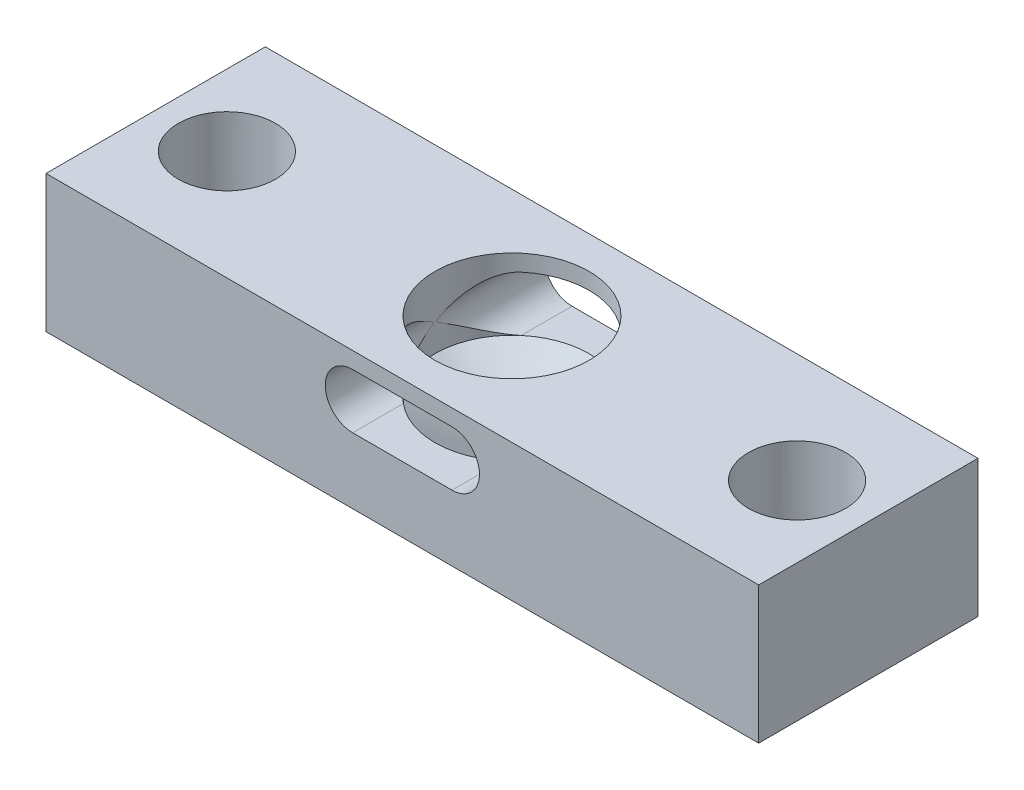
ISO-10303-21;
HEADER;
FILE_DESCRIPTION(('STEP AP214'),'2;1');
FILE_NAME('part.step','',(''),(''),'','','');
FILE_SCHEMA(('AUTOMOTIVE_DESIGN { 1 0 10303 214 1 1 1 1 }'));
ENDSEC;
DATA;
#1=APPLICATION_CONTEXT('core data for automotive mechanical design processes');
#2=APPLICATION_PROTOCOL_DEFINITION('international standard','automotive_design',2000,#1);
#3=PRODUCT_CONTEXT('',#1,'mechanical');
#4=PRODUCT('Part','Part','',(#3));
#5=PRODUCT_RELATED_PRODUCT_CATEGORY('part','',(#4));
#6=PRODUCT_DEFINITION_FORMATION('','',#4);
#7=PRODUCT_DEFINITION_CONTEXT('part definition',#1,'design');
#8=PRODUCT_DEFINITION('design','',#6,#7);
#9=PRODUCT_DEFINITION_SHAPE('','',#8);
#10=(LENGTH_UNIT() NAMED_UNIT(*) SI_UNIT(.MILLI.,.METRE.));
#11=(NAMED_UNIT(*) PLANE_ANGLE_UNIT() SI_UNIT($,.RADIAN.));
#12=(NAMED_UNIT(*) SI_UNIT($,.STERADIAN.) SOLID_ANGLE_UNIT());
#13=UNCERTAINTY_MEASURE_WITH_UNIT(LENGTH_MEASURE(1.E-05),#10,'distance_accuracy_value','');
#14=(GEOMETRIC_REPRESENTATION_CONTEXT(3) GLOBAL_UNCERTAINTY_ASSIGNED_CONTEXT((#13)) GLOBAL_UNIT_ASSIGNED_CONTEXT((#10,
#11,#12)) REPRESENTATION_CONTEXT('',''));
#15=CARTESIAN_POINT('',(0.,0.,0.));
#16=DIRECTION('',(0.,0.,1.));
#17=DIRECTION('',(1.,0.,0.));
#18=AXIS2_PLACEMENT_3D('',#15,#16,#17);
#19=CARTESIAN_POINT('',(-29.3592068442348,20.1742035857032,10.16));
#20=DIRECTION('',(1.,0.,0.));
#21=DIRECTION('',(0.,0.,-1.));
#22=AXIS2_PLACEMENT_3D('',#19,#20,#21);
#23=PLANE('',#22);
#24=DIRECTION('',(0.,0.,1.));
#25=VECTOR('',#24,1.);
#26=CARTESIAN_POINT('',(-29.3592068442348,13.8242035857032,0.));
#27=LINE('',#26,#25);
#28=CARTESIAN_POINT('',(-29.3592068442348,13.8242035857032,0.));
#29=VERTEX_POINT('',#28);
#30=CARTESIAN_POINT('',(-29.3592068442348,13.8242035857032,10.16));
#31=VERTEX_POINT('',#30);
#32=EDGE_CURVE('E60',#29,#31,#27,.T.);
#33=ORIENTED_EDGE('',*,*,#32,.T.);
#34=DIRECTION('',(0.,-1.,0.));
#35=VECTOR('',#34,1.);
#36=CARTESIAN_POINT('',(-29.3592068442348,20.1742035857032,10.16));
#37=LINE('',#36,#35);
#38=CARTESIAN_POINT('',(-29.3592068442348,20.1742035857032,10.16));
#39=VERTEX_POINT('',#38);
#40=EDGE_CURVE('E168',#39,#31,#37,.T.);
#41=ORIENTED_EDGE('',*,*,#40,.F.);
#42=DIRECTION('',(0.,0.,-1.));
#43=VECTOR('',#42,1.);
#44=CARTESIAN_POINT('',(-29.3592068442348,20.1742035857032,10.16));
#45=LINE('',#44,#43);
#46=CARTESIAN_POINT('',(-29.3592068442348,20.1742035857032,0.));
#47=VERTEX_POINT('',#46);
#48=EDGE_CURVE('E174',#39,#47,#45,.T.);
#49=ORIENTED_EDGE('',*,*,#48,.T.);
#50=DIRECTION('',(0.,-1.,0.));
#51=VECTOR('',#50,1.);
#52=CARTESIAN_POINT('',(-29.3592068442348,20.1742035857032,0.));
#53=LINE('',#52,#51);
#54=EDGE_CURVE('E162',#47,#29,#53,.T.);
#55=ORIENTED_EDGE('',*,*,#54,.T.);
#56=EDGE_LOOP('',(#33,#41,#49,#55));
#57=FACE_BOUND('',#56,.T.);
#58=ADVANCED_FACE('F44',(#57),#23,.F.);
#59=CARTESIAN_POINT('',(3.66079315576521,20.1742035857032,10.16));
#60=DIRECTION('',(-1.,0.,0.));
#61=DIRECTION('',(0.,0.,1.));
#62=AXIS2_PLACEMENT_3D('',#59,#60,#61);
#63=PLANE('',#62);
#64=DIRECTION('',(0.,0.,1.));
#65=VECTOR('',#64,1.);
#66=CARTESIAN_POINT('',(3.66079315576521,13.8242035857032,0.));
#67=LINE('',#66,#65);
#68=CARTESIAN_POINT('',(3.66079315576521,13.8242035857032,0.));
#69=VERTEX_POINT('',#68);
#70=CARTESIAN_POINT('',(3.66079315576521,13.8242035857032,10.16));
#71=VERTEX_POINT('',#70);
#72=EDGE_CURVE('E140',#69,#71,#67,.T.);
#73=ORIENTED_EDGE('',*,*,#72,.F.);
#74=DIRECTION('',(0.,1.,0.));
#75=VECTOR('',#74,1.);
#76=CARTESIAN_POINT('',(3.66079315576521,20.1742035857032,0.));
#77=LINE('',#76,#75);
#78=CARTESIAN_POINT('',(3.66079315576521,20.1742035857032,0.));
#79=VERTEX_POINT('',#78);
#80=EDGE_CURVE('E153',#69,#79,#77,.T.);
#81=ORIENTED_EDGE('',*,*,#80,.T.);
#82=DIRECTION('',(0.,0.,-1.));
#83=VECTOR('',#82,1.);
#84=CARTESIAN_POINT('',(3.66079315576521,20.1742035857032,10.16));
#85=LINE('',#84,#83);
#86=CARTESIAN_POINT('',(3.66079315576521,20.1742035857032,10.16));
#87=VERTEX_POINT('',#86);
#88=EDGE_CURVE('E178',#87,#79,#85,.T.);
#89=ORIENTED_EDGE('',*,*,#88,.F.);
#90=DIRECTION('',(0.,1.,0.));
#91=VECTOR('',#90,1.);
#92=CARTESIAN_POINT('',(3.66079315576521,20.1742035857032,10.16));
#93=LINE('',#92,#91);
#94=EDGE_CURVE('E155',#71,#87,#93,.T.);
#95=ORIENTED_EDGE('',*,*,#94,.F.);
#96=EDGE_LOOP('',(#73,#81,#89,#95));
#97=FACE_BOUND('',#96,.T.);
#98=ADVANCED_FACE('F151',(#97),#63,.F.);
#99=CARTESIAN_POINT('',(0.,0.,10.16));
#100=DIRECTION('',(0.,0.,1.));
#101=DIRECTION('',(1.,0.,0.));
#102=AXIS2_PLACEMENT_3D('',#99,#100,#101);
#103=PLANE('',#102);
#104=CARTESIAN_POINT('',(-15.1504468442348,18.1422035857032,10.16));
#105=DIRECTION('',(0.,0.,1.));
#106=DIRECTION('',(1.,0.,0.));
#107=AXIS2_PLACEMENT_3D('',#104,#105,#106);
#108=CIRCLE('',#107,1.26999999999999);
#109=CARTESIAN_POINT('',(-15.1504468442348,19.4122035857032,10.16));
#110=VERTEX_POINT('',#109);
#111=CARTESIAN_POINT('',(-15.1504468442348,16.8722035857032,10.16));
#112=VERTEX_POINT('',#111);
#113=EDGE_CURVE('E68',#110,#112,#108,.T.);
#114=ORIENTED_EDGE('',*,*,#113,.F.);
#115=DIRECTION('',(-1.,0.,0.));
#116=VECTOR('',#115,1.);
#117=CARTESIAN_POINT('',(-15.1504468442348,19.4122035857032,10.16));
#118=LINE('',#117,#116);
#119=CARTESIAN_POINT('',(-10.5479668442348,19.4122035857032,10.16));
#120=VERTEX_POINT('',#119);
#121=EDGE_CURVE('E369',#120,#110,#118,.T.);
#122=ORIENTED_EDGE('',*,*,#121,.F.);
#123=CARTESIAN_POINT('',(-10.5479668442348,18.1422035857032,10.16));
#124=DIRECTION('',(0.,0.,1.));
#125=DIRECTION('',(1.,0.,0.));
#126=AXIS2_PLACEMENT_3D('',#123,#124,#125);
#127=CIRCLE('',#126,1.26999999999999);
#128=CARTESIAN_POINT('',(-10.5479668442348,16.8722035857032,10.16));
#129=VERTEX_POINT('',#128);
#130=EDGE_CURVE('E375',#129,#120,#127,.T.);
#131=ORIENTED_EDGE('',*,*,#130,.F.);
#132=DIRECTION('',(1.,0.,0.));
#133=VECTOR('',#132,1.);
#134=CARTESIAN_POINT('',(-15.1504468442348,16.8722035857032,10.16));
#135=LINE('',#134,#133);
#136=EDGE_CURVE('E381',#112,#129,#135,.T.);
#137=ORIENTED_EDGE('',*,*,#136,.F.);
#138=EDGE_LOOP('',(#114,#122,#131,#137));
#139=FACE_BOUND('',#138,.T.);
#140=ORIENTED_EDGE('',*,*,#40,.T.);
#141=DIRECTION('',(1.,0.,0.));
#142=VECTOR('',#141,1.);
#143=CARTESIAN_POINT('',(0.,13.8242035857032,10.16));
#144=LINE('',#143,#142);
#145=EDGE_CURVE('E147',#31,#71,#144,.T.);
#146=ORIENTED_EDGE('',*,*,#145,.T.);
#147=ORIENTED_EDGE('',*,*,#94,.T.);
#148=DIRECTION('',(-1.,0.,0.));
#149=VECTOR('',#148,1.);
#150=CARTESIAN_POINT('',(-29.3592068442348,20.1742035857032,10.16));
#151=LINE('',#150,#149);
#152=EDGE_CURVE('E179',#87,#39,#151,.T.);
#153=ORIENTED_EDGE('',*,*,#152,.T.);
#154=EDGE_LOOP('',(#140,#146,#147,#153));
#155=FACE_BOUND('',#154,.T.);
#156=ADVANCED_FACE('F244',(#139,#155),#103,.T.);
#157=CARTESIAN_POINT('',(0.,0.,0.));
#158=DIRECTION('',(0.,0.,1.));
#159=DIRECTION('',(1.,0.,0.));
#160=AXIS2_PLACEMENT_3D('',#157,#158,#159);
#161=PLANE('',#160);
#162=DIRECTION('',(-1.,0.,0.));
#163=VECTOR('',#162,1.);
#164=CARTESIAN_POINT('',(-15.1504468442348,19.4122035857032,0.));
#165=LINE('',#164,#163);
#166=CARTESIAN_POINT('',(-10.5479668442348,19.4122035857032,0.));
#167=VERTEX_POINT('',#166);
#168=CARTESIAN_POINT('',(-15.1504468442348,19.4122035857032,0.));
#169=VERTEX_POINT('',#168);
#170=EDGE_CURVE('E346',#167,#169,#165,.T.);
#171=ORIENTED_EDGE('',*,*,#170,.T.);
#172=CARTESIAN_POINT('',(-15.1504468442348,18.1422035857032,0.));
#173=DIRECTION('',(0.,0.,1.));
#174=DIRECTION('',(1.,0.,0.));
#175=AXIS2_PLACEMENT_3D('',#172,#173,#174);
#176=CIRCLE('',#175,1.26999999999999);
#177=CARTESIAN_POINT('',(-15.1504468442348,16.8722035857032,0.));
#178=VERTEX_POINT('',#177);
#179=EDGE_CURVE('E363',#169,#178,#176,.T.);
#180=ORIENTED_EDGE('',*,*,#179,.T.);
#181=DIRECTION('',(1.,0.,0.));
#182=VECTOR('',#181,1.);
#183=CARTESIAN_POINT('',(-15.1504468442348,16.8722035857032,0.));
#184=LINE('',#183,#182);
#185=CARTESIAN_POINT('',(-10.5479668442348,16.8722035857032,0.));
#186=VERTEX_POINT('',#185);
#187=EDGE_CURVE('E357',#178,#186,#184,.T.);
#188=ORIENTED_EDGE('',*,*,#187,.T.);
#189=CARTESIAN_POINT('',(-10.5479668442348,18.1422035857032,0.));
#190=DIRECTION('',(0.,0.,1.));
#191=DIRECTION('',(1.,0.,0.));
#192=AXIS2_PLACEMENT_3D('',#189,#190,#191);
#193=CIRCLE('',#192,1.26999999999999);
#194=EDGE_CURVE('E351',#186,#167,#193,.T.);
#195=ORIENTED_EDGE('',*,*,#194,.T.);
#196=EDGE_LOOP('',(#171,#180,#188,#195));
#197=FACE_BOUND('',#196,.T.);
#198=DIRECTION('',(1.,0.,0.));
#199=VECTOR('',#198,1.);
#200=CARTESIAN_POINT('',(0.,13.8242035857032,0.));
#201=LINE('',#200,#199);
#202=EDGE_CURVE('E136',#29,#69,#201,.T.);
#203=ORIENTED_EDGE('',*,*,#202,.F.);
#204=ORIENTED_EDGE('',*,*,#54,.F.);
#205=DIRECTION('',(-1.,0.,0.));
#206=VECTOR('',#205,1.);
#207=CARTESIAN_POINT('',(-29.3592068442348,20.1742035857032,0.));
#208=LINE('',#207,#206);
#209=EDGE_CURVE('E160',#79,#47,#208,.T.);
#210=ORIENTED_EDGE('',*,*,#209,.F.);
#211=ORIENTED_EDGE('',*,*,#80,.F.);
#212=EDGE_LOOP('',(#203,#204,#210,#211));
#213=FACE_BOUND('',#212,.T.);
#214=ADVANCED_FACE('F159',(#197,#213),#161,.F.);
#215=CARTESIAN_POINT('',(0.358793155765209,20.1742035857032,5.08));
#216=DIRECTION('',(0.,1.,0.));
#217=DIRECTION('',(0.,0.,1.));
#218=AXIS2_PLACEMENT_3D('',#215,#216,#217);
#219=CYLINDRICAL_SURFACE('',#218,2.2479);
#220=CARTESIAN_POINT('',(0.358793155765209,20.1742035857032,5.08));
#221=DIRECTION('',(0.,1.,0.));
#222=DIRECTION('',(0.,0.,1.));
#223=AXIS2_PLACEMENT_3D('',#220,#221,#222);
#224=CIRCLE('',#223,2.2479);
#225=CARTESIAN_POINT('',(0.358793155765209,20.1742035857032,7.3279));
#226=VERTEX_POINT('',#225);
#227=EDGE_CURVE('E170',#226,#226,#224,.T.);
#228=ORIENTED_EDGE('',*,*,#227,.T.);
#229=EDGE_LOOP('',(#228));
#230=FACE_BOUND('',#229,.T.);
#231=CARTESIAN_POINT('',(0.358793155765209,13.8242035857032,5.08));
#232=DIRECTION('',(0.,-1.,0.));
#233=DIRECTION('',(0.,0.,-1.));
#234=AXIS2_PLACEMENT_3D('',#231,#232,#233);
#235=CIRCLE('',#234,2.2479);
#236=CARTESIAN_POINT('',(0.358793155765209,13.8242035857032,2.8321));
#237=VERTEX_POINT('',#236);
#238=EDGE_CURVE('E391',#237,#237,#235,.F.);
#239=ORIENTED_EDGE('',*,*,#238,.F.);
#240=EDGE_LOOP('',(#239));
#241=FACE_BOUND('',#240,.T.);
#242=ADVANCED_FACE('F418',(#230,#241),#219,.F.);
#243=CARTESIAN_POINT('',(-26.0572068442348,20.1742035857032,5.08));
#244=DIRECTION('',(0.,1.,0.));
#245=DIRECTION('',(0.,0.,1.));
#246=AXIS2_PLACEMENT_3D('',#243,#244,#245);
#247=CYLINDRICAL_SURFACE('',#246,2.2479);
#248=CARTESIAN_POINT('',(-26.0572068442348,20.1742035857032,5.08));
#249=DIRECTION('',(0.,1.,0.));
#250=DIRECTION('',(0.,0.,1.));
#251=AXIS2_PLACEMENT_3D('',#248,#249,#250);
#252=CIRCLE('',#251,2.2479);
#253=CARTESIAN_POINT('',(-26.0572068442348,20.1742035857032,7.3279));
#254=VERTEX_POINT('',#253);
#255=EDGE_CURVE('E275',#254,#254,#252,.T.);
#256=ORIENTED_EDGE('',*,*,#255,.T.);
#257=EDGE_LOOP('',(#256));
#258=FACE_BOUND('',#257,.T.);
#259=CARTESIAN_POINT('',(-26.0572068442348,13.8242035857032,5.08));
#260=DIRECTION('',(0.,-1.,0.));
#261=DIRECTION('',(0.,0.,-1.));
#262=AXIS2_PLACEMENT_3D('',#259,#260,#261);
#263=CIRCLE('',#262,2.2479);
#264=CARTESIAN_POINT('',(-26.0572068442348,13.8242035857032,2.8321));
#265=VERTEX_POINT('',#264);
#266=EDGE_CURVE('E47',#265,#265,#263,.F.);
#267=ORIENTED_EDGE('',*,*,#266,.F.);
#268=EDGE_LOOP('',(#267));
#269=FACE_BOUND('',#268,.T.);
#270=ADVANCED_FACE('F415',(#258,#269),#247,.F.);
#271=CARTESIAN_POINT('',(-29.3592068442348,20.1742035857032,10.16));
#272=DIRECTION('',(0.,-1.,0.));
#273=DIRECTION('',(0.,0.,-1.));
#274=AXIS2_PLACEMENT_3D('',#271,#272,#273);
#275=PLANE('',#274);
#276=CARTESIAN_POINT('',(-12.8492068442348,20.1742035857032,5.08));
#277=DIRECTION('',(0.,1.,0.));
#278=DIRECTION('',(0.,0.,1.));
#279=AXIS2_PLACEMENT_3D('',#276,#277,#278);
#280=CIRCLE('',#279,3.571875);
#281=CARTESIAN_POINT('',(-12.8492068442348,20.1742035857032,8.651875));
#282=VERTEX_POINT('',#281);
#283=EDGE_CURVE('E301',#282,#282,#280,.T.);
#284=ORIENTED_EDGE('',*,*,#283,.F.);
#285=EDGE_LOOP('',(#284));
#286=FACE_BOUND('',#285,.T.);
#287=ORIENTED_EDGE('',*,*,#255,.F.);
#288=EDGE_LOOP('',(#287));
#289=FACE_BOUND('',#288,.T.);
#290=ORIENTED_EDGE('',*,*,#227,.F.);
#291=EDGE_LOOP('',(#290));
#292=FACE_BOUND('',#291,.T.);
#293=ORIENTED_EDGE('',*,*,#209,.T.);
#294=ORIENTED_EDGE('',*,*,#48,.F.);
#295=ORIENTED_EDGE('',*,*,#152,.F.);
#296=ORIENTED_EDGE('',*,*,#88,.T.);
#297=EDGE_LOOP('',(#293,#294,#295,#296));
#298=FACE_BOUND('',#297,.T.);
#299=ADVANCED_FACE('F417',(#286,#289,#292,#298),#275,.F.);
#300=CARTESIAN_POINT('',(-12.8492068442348,16.8722035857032,5.08));
#301=DIRECTION('',(0.,1.,0.));
#302=DIRECTION('',(0.,0.,1.));
#303=AXIS2_PLACEMENT_3D('',#300,#301,#302);
#304=CONICAL_SURFACE('',#303,3.571875,1.02974425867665);
#305=CARTESIAN_POINT('',(-12.8492068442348,14.7260045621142,5.08));
#306=VERTEX_POINT('',#305);
#307=VERTEX_LOOP('',#306);
#308=FACE_BOUND('',#307,.T.);
#309=CARTESIAN_POINT('',(-12.8492068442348,16.8722035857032,5.08));
#310=DIRECTION('',(0.,1.,0.));
#311=DIRECTION('',(0.,0.,1.));
#312=AXIS2_PLACEMENT_3D('',#309,#310,#311);
#313=CIRCLE('',#312,3.571875);
#314=CARTESIAN_POINT('',(-10.5479668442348,16.8722035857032,7.81177332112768));
#315=VERTEX_POINT('',#314);
#316=CARTESIAN_POINT('',(-10.5479668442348,16.8722035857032,2.34822667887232));
#317=VERTEX_POINT('',#316);
#318=EDGE_CURVE('E280',#315,#317,#313,.T.);
#319=ORIENTED_EDGE('',*,*,#318,.T.);
#320=CARTESIAN_POINT('',(-15.1504468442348,16.8722035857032,2.34822667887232));
#321=VERTEX_POINT('',#320);
#322=EDGE_CURVE('E285',#317,#321,#313,.T.);
#323=ORIENTED_EDGE('',*,*,#322,.T.);
#324=CARTESIAN_POINT('',(-15.1504468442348,16.8722035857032,7.81177332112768));
#325=VERTEX_POINT('',#324);
#326=EDGE_CURVE('E292',#321,#325,#313,.T.);
#327=ORIENTED_EDGE('',*,*,#326,.T.);
#328=EDGE_CURVE('E287',#325,#315,#313,.T.);
#329=ORIENTED_EDGE('',*,*,#328,.T.);
#330=EDGE_LOOP('',(#319,#323,#327,#329));
#331=FACE_BOUND('',#330,.T.);
#332=ADVANCED_FACE('F425',(#308,#331),#304,.F.);
#333=CARTESIAN_POINT('',(-12.8492068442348,20.1742035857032,5.08));
#334=DIRECTION('',(0.,1.,0.));
#335=DIRECTION('',(0.,0.,1.));
#336=AXIS2_PLACEMENT_3D('',#333,#334,#335);
#337=CYLINDRICAL_SURFACE('',#336,3.571875);
#338=ORIENTED_EDGE('',*,*,#326,.F.);
#339=CARTESIAN_POINT('',(-15.1504468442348,16.8722035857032,2.34822667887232));
#340=CARTESIAN_POINT('',(-15.1918067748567,16.8722092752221,2.38306230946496));
#341=CARTESIAN_POINT('',(-15.2323323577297,16.8742227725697,2.41881308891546));
#342=CARTESIAN_POINT('',(-15.3114918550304,16.8818282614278,2.49188591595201));
#343=CARTESIAN_POINT('',(-15.3501283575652,16.8874152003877,2.52920567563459));
#344=CARTESIAN_POINT('',(-15.4623698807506,16.9087638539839,2.64260310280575));
#345=CARTESIAN_POINT('',(-15.5330504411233,16.9291294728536,2.72074810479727));
#346=CARTESIAN_POINT('',(-15.65157078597,16.9739216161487,2.86375437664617));
#347=CARTESIAN_POINT('',(-15.7010561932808,16.9965371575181,2.92786496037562));
#348=CARTESIAN_POINT('',(-15.7947853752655,17.0465089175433,3.05804902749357));
#349=CARTESIAN_POINT('',(-15.8390285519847,17.0738656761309,3.12412273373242));
#350=CARTESIAN_POINT('',(-15.9225974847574,17.1325951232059,3.25822979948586));
#351=CARTESIAN_POINT('',(-15.9618897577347,17.1639925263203,3.32627303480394));
#352=CARTESIAN_POINT('',(-16.0353523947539,17.2299115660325,3.46357503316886));
#353=CARTESIAN_POINT('',(-16.0695229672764,17.2644330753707,3.53283374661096));
#354=CARTESIAN_POINT('',(-16.1476004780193,17.3525936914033,3.70469277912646));
#355=CARTESIAN_POINT('',(-16.1886684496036,17.4076711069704,3.80785268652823));
#356=CARTESIAN_POINT('',(-16.2605858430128,17.521691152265,4.01562955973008));
#357=CARTESIAN_POINT('',(-16.2914284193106,17.5806363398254,4.12024745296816));
#358=CARTESIAN_POINT('',(-16.3431348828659,17.7009816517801,4.33007632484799));
#359=CARTESIAN_POINT('',(-16.3640300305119,17.7623734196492,4.43528438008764));
#360=CARTESIAN_POINT('',(-16.3881645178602,17.8558723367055,4.59326734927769));
#361=CARTESIAN_POINT('',(-16.3950071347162,17.8872655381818,4.64594315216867));
#362=CARTESIAN_POINT('',(-16.4063145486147,17.9505323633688,4.75125800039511));
#363=CARTESIAN_POINT('',(-16.410779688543,17.9824059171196,4.80389704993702));
#364=CARTESIAN_POINT('',(-16.415452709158,18.0288325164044,4.87832155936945));
#365=CARTESIAN_POINT('',(-16.4166313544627,18.0427875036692,4.90041463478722));
#366=CARTESIAN_POINT('',(-16.4181926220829,18.0660434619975,4.93573036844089));
#367=CARTESIAN_POINT('',(-16.4187073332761,18.0750859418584,4.94911767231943));
#368=CARTESIAN_POINT('',(-16.4194109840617,18.0905657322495,4.97045273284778));
#369=CARTESIAN_POINT('',(-16.4196500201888,18.0967308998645,4.97858243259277));
#370=CARTESIAN_POINT('',(-16.4199554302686,18.1067210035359,4.99021576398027));
#371=CARTESIAN_POINT('',(-16.420048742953,18.1101961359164,4.99401950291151));
#372=CARTESIAN_POINT('',(-16.4202138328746,18.1175925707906,5.00118201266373));
#373=CARTESIAN_POINT('',(-16.4202857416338,18.1215109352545,5.00454342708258));
#374=CARTESIAN_POINT('',(-16.4203628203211,18.1275039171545,5.00832554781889));
#375=CARTESIAN_POINT('',(-16.4203818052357,18.1292260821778,5.00928167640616));
#376=CARTESIAN_POINT('',(-16.4204133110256,18.1328039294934,5.01089127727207));
#377=CARTESIAN_POINT('',(-16.4204258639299,18.134658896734,5.01154624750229));
#378=CARTESIAN_POINT('',(-16.4204403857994,18.1379296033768,5.01230867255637));
#379=CARTESIAN_POINT('',(-16.4204443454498,18.1393209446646,5.01251865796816));
#380=CARTESIAN_POINT('',(-16.4204476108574,18.1421198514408,5.01269166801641));
#381=CARTESIAN_POINT('',(-16.4204469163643,18.1435274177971,5.01265467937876));
#382=CARTESIAN_POINT('',(-16.4204409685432,18.1463094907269,5.01234007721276));
#383=CARTESIAN_POINT('',(-16.4204357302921,18.1476840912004,5.01206325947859));
#384=CARTESIAN_POINT('',(-16.4204212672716,18.1503754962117,5.01130717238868));
#385=CARTESIAN_POINT('',(-16.4204120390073,18.1516922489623,5.01082772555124));
#386=CARTESIAN_POINT('',(-16.4203817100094,18.1552699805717,5.00927483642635));
#387=CARTESIAN_POINT('',(-16.4203569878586,18.1574557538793,5.00803126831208));
#388=CARTESIAN_POINT('',(-16.4202998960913,18.1616344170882,5.0052506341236));
#389=CARTESIAN_POINT('',(-16.4202674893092,18.163626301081,5.00371214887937));
#390=CARTESIAN_POINT('',(-16.4201001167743,18.1727598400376,4.99605029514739));
#391=CARTESIAN_POINT('',(-16.4199278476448,18.1790260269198,4.98893574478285));
#392=CARTESIAN_POINT('',(-16.4195238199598,18.1909577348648,4.97423769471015));
#393=CARTESIAN_POINT('',(-16.419291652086,18.1966187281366,4.96665125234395));
#394=CARTESIAN_POINT('',(-16.4180033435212,18.2239852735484,4.92872129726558));
#395=CARTESIAN_POINT('',(-16.4165323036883,18.2439045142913,4.89707906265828));
#396=CARTESIAN_POINT('',(-16.4127335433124,18.2832668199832,4.83383897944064));
#397=CARTESIAN_POINT('',(-16.4104096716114,18.3027116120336,4.80224156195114));
#398=CARTESIAN_POINT('',(-16.4021219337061,18.360750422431,4.70699877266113));
#399=CARTESIAN_POINT('',(-16.394850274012,18.3988874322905,4.6431576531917));
#400=CARTESIAN_POINT('',(-16.3768017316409,18.4745471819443,4.51561121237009));
#401=CARTESIAN_POINT('',(-16.3660236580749,18.5120697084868,4.45190594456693));
#402=CARTESIAN_POINT('',(-16.3282496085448,18.6237551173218,4.26055463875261));
#403=CARTESIAN_POINT('',(-16.2958582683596,18.6967186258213,4.13319743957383));
#404=CARTESIAN_POINT('',(-16.2276198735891,18.8174279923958,3.91656787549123));
#405=CARTESIAN_POINT('',(-16.19541130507,18.8664174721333,3.82682161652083));
#406=CARTESIAN_POINT('',(-16.1231366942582,18.9609320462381,3.64859540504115));
#407=CARTESIAN_POINT('',(-16.0830681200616,19.0064560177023,3.56011587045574));
#408=CARTESIAN_POINT('',(-15.9950736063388,19.0926107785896,3.38550478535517));
#409=CARTESIAN_POINT('',(-15.9471987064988,19.1332705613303,3.29936196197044));
#410=CARTESIAN_POINT('',(-15.84314747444,19.2085940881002,3.12948237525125));
#411=CARTESIAN_POINT('',(-15.7869748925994,19.2432605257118,3.04574454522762));
#412=CARTESIAN_POINT('',(-15.6862113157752,19.2945521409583,2.90874648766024));
#413=CARTESIAN_POINT('',(-15.6439492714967,19.3133493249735,2.85458050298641));
#414=CARTESIAN_POINT('',(-15.5557092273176,19.3467307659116,2.74806614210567));
#415=CARTESIAN_POINT('',(-15.5097345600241,19.3613187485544,2.69571619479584));
#416=CARTESIAN_POINT('',(-15.4135855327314,19.3856451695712,2.59257799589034));
#417=CARTESIAN_POINT('',(-15.3633680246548,19.395324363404,2.54181545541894));
#418=CARTESIAN_POINT('',(-15.2594259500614,19.4086026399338,2.44289294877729));
#419=CARTESIAN_POINT('',(-15.2056921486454,19.4121849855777,2.39474049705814));
#420=CARTESIAN_POINT('',(-15.1504468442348,19.4122035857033,2.34822667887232));
#421=B_SPLINE_CURVE_WITH_KNOTS('',3,(#339,#340,#341,#342,#343,#344,#345,#346,#347,#348,#349,
#350,#351,#352,#353,#354,#355,#356,#357,#358,#359,#360,#361,#362,#363,#364,#365,#366,#367,#368,
#369,#370,#371,#372,#373,#374,#375,#376,#377,#378,#379,#380,#381,#382,#383,#384,#385,#386,#387,
#388,#389,#390,#391,#392,#393,#394,#395,#396,#397,#398,#399,#400,#401,#402,#403,#404,#405,#406,
#407,#408,#409,#410,#411,#412,#413,#414,#415,#416,#417,#418,#419,#420),.UNSPECIFIED.,.F.,.F.,(4,
2,2,2,2,2,2,2,2,2,2,2,2,2,2,2,2,2,2,2,2,2,2,2,2,2,2,2,2,2,2,2,2,2,2,2,2,2,2,2,4),(0.,
0.162096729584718,0.323964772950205,0.64480874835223,0.896759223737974,1.14873841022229,
1.4023394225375,1.65593010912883,2.02718517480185,2.39868828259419,2.76901608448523,
2.95408412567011,3.13912546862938,3.21758499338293,3.2660735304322,3.2966434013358,
3.31210071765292,3.32746099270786,3.33335237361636,3.33921412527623,3.34341568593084,
3.34761747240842,3.35180536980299,3.35599694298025,3.36349749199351,3.37103508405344,
3.39926687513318,3.42769694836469,3.53975420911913,3.65131185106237,3.87533225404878,
4.09942882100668,4.54945817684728,4.87076542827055,5.19217635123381,5.51156438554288,
5.83080850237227,6.0442814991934,6.25756495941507,6.47336469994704,6.68975590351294),.UNSPECIFIED.);
#422=CARTESIAN_POINT('',(-15.1504468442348,19.4122035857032,2.34822667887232));
#423=VERTEX_POINT('',#422);
#424=EDGE_CURVE('E11',#321,#423,#421,.T.);
#425=ORIENTED_EDGE('',*,*,#424,.T.);
#426=CARTESIAN_POINT('',(-12.8492068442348,19.4122035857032,5.08));
#427=DIRECTION('',(0.,1.,0.));
#428=DIRECTION('',(0.,0.,1.));
#429=AXIS2_PLACEMENT_3D('',#426,#427,#428);
#430=CIRCLE('',#429,3.571875);
#431=CARTESIAN_POINT('',(-10.5479668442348,19.4122035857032,2.34822667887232));
#432=VERTEX_POINT('',#431);
#433=EDGE_CURVE('E53',#423,#432,#430,.F.);
#434=ORIENTED_EDGE('',*,*,#433,.T.);
#435=CARTESIAN_POINT('',(-10.5479668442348,19.4122035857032,2.34822667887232));
#436=CARTESIAN_POINT('',(-10.5066069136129,19.4121978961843,2.38306230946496));
#437=CARTESIAN_POINT('',(-10.4660813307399,19.4101843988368,2.41881308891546));
#438=CARTESIAN_POINT('',(-10.3869218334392,19.4025789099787,2.49188591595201));
#439=CARTESIAN_POINT('',(-10.3482853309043,19.3969919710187,2.52920567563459));
#440=CARTESIAN_POINT('',(-10.236043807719,19.3756433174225,2.64260310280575));
#441=CARTESIAN_POINT('',(-10.1653632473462,19.3552776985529,2.72074810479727));
#442=CARTESIAN_POINT('',(-10.0468429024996,19.3104855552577,2.86375437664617));
#443=CARTESIAN_POINT('',(-9.99735749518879,19.2878700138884,2.92786496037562));
#444=CARTESIAN_POINT('',(-9.90362831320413,19.2378982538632,3.05804902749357));
#445=CARTESIAN_POINT('',(-9.85938513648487,19.2105414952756,3.12412273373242));
#446=CARTESIAN_POINT('',(-9.77581620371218,19.1518120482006,3.25822979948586));
#447=CARTESIAN_POINT('',(-9.73652393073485,19.1204146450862,3.32627303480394));
#448=CARTESIAN_POINT('',(-9.66306129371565,19.054495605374,3.46357503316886));
#449=CARTESIAN_POINT('',(-9.62889072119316,19.0199740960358,3.53283374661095));
#450=CARTESIAN_POINT('',(-9.55081321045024,18.9318134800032,3.70469277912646));
#451=CARTESIAN_POINT('',(-9.50974523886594,18.8767360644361,3.80785268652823));
#452=CARTESIAN_POINT('',(-9.43782784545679,18.7627160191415,4.01562955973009));
#453=CARTESIAN_POINT('',(-9.40698526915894,18.7037708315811,4.12024745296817));
#454=CARTESIAN_POINT('',(-9.35527880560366,18.5834255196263,4.33007632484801));
#455=CARTESIAN_POINT('',(-9.33438365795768,18.5220337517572,4.43528438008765));
#456=CARTESIAN_POINT('',(-9.31024917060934,18.428534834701,4.5932673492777));
#457=CARTESIAN_POINT('',(-9.30340655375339,18.3971416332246,4.64594315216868));
#458=CARTESIAN_POINT('',(-9.29209913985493,18.3338748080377,4.75125800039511));
#459=CARTESIAN_POINT('',(-9.28763399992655,18.3020012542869,4.80389704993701));
#460=CARTESIAN_POINT('',(-9.28296097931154,18.255574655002,4.87832155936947));
#461=CARTESIAN_POINT('',(-9.28178233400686,18.2416196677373,4.90041463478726));
#462=CARTESIAN_POINT('',(-9.28022106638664,18.2183637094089,4.93573036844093));
#463=CARTESIAN_POINT('',(-9.27970635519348,18.2093212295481,4.94911767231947));
#464=CARTESIAN_POINT('',(-9.27900270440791,18.193841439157,4.97045273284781));
#465=CARTESIAN_POINT('',(-9.27876366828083,18.187676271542,4.97858243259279));
#466=CARTESIAN_POINT('',(-9.27845825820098,18.1776861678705,4.99021576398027));
#467=CARTESIAN_POINT('',(-9.27836494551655,18.17421103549,4.99401950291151));
#468=CARTESIAN_POINT('',(-9.278199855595,18.1668146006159,5.00118201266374));
#469=CARTESIAN_POINT('',(-9.2781279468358,18.162896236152,5.00454342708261));
#470=CARTESIAN_POINT('',(-9.27805086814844,18.156903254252,5.00832554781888));
#471=CARTESIAN_POINT('',(-9.27803188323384,18.1551810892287,5.00928167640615));
#472=CARTESIAN_POINT('',(-9.27800037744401,18.1516032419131,5.01089127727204));
#473=CARTESIAN_POINT('',(-9.27798782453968,18.1497482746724,5.01154624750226));
#474=CARTESIAN_POINT('',(-9.27797330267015,18.1464775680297,5.01230867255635));
#475=CARTESIAN_POINT('',(-9.27796934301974,18.1450862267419,5.01251865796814));
#476=CARTESIAN_POINT('',(-9.27796607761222,18.1422873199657,5.0126916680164));
#477=CARTESIAN_POINT('',(-9.27796677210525,18.1408797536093,5.01265467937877));
#478=CARTESIAN_POINT('',(-9.27797271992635,18.1380976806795,5.01234007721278));
#479=CARTESIAN_POINT('',(-9.27797795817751,18.1367230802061,5.01206325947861));
#480=CARTESIAN_POINT('',(-9.27799242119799,18.1340316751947,5.01130717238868));
#481=CARTESIAN_POINT('',(-9.2780016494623,18.1327149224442,5.01082772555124));
#482=CARTESIAN_POINT('',(-9.27803197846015,18.1291371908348,5.00927483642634));
#483=CARTESIAN_POINT('',(-9.27805670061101,18.1269514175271,5.00803126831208));
#484=CARTESIAN_POINT('',(-9.2781137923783,18.1227727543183,5.0052506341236));
#485=CARTESIAN_POINT('',(-9.27814619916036,18.1207808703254,5.00371214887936));
#486=CARTESIAN_POINT('',(-9.27831357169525,18.1116473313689,4.99605029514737));
#487=CARTESIAN_POINT('',(-9.27848584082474,18.1053811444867,4.98893574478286));
#488=CARTESIAN_POINT('',(-9.27888986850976,18.0934494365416,4.97423769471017));
#489=CARTESIAN_POINT('',(-9.27912203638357,18.0877884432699,4.96665125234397));
#490=CARTESIAN_POINT('',(-9.28041034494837,18.0604218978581,4.9287212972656));
#491=CARTESIAN_POINT('',(-9.28188138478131,18.0405026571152,4.89707906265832));
#492=CARTESIAN_POINT('',(-9.28568014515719,18.0011403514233,4.83383897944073));
#493=CARTESIAN_POINT('',(-9.28800401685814,17.981695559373,4.80224156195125));
#494=CARTESIAN_POINT('',(-9.29629175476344,17.9236567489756,4.70699877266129));
#495=CARTESIAN_POINT('',(-9.30356341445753,17.8855197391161,4.64315765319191));
#496=CARTESIAN_POINT('',(-9.32161195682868,17.8098599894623,4.51561121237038));
#497=CARTESIAN_POINT('',(-9.33239003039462,17.7723374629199,4.45190594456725));
#498=CARTESIAN_POINT('',(-9.37016407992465,17.6606520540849,4.26055463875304));
#499=CARTESIAN_POINT('',(-9.40255542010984,17.5876885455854,4.13319743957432));
#500=CARTESIAN_POINT('',(-9.47079381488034,17.4669791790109,3.91656787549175));
#501=CARTESIAN_POINT('',(-9.50300238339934,17.4179896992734,3.82682161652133));
#502=CARTESIAN_POINT('',(-9.57527699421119,17.3234751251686,3.64859540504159));
#503=CARTESIAN_POINT('',(-9.61534556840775,17.2779511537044,3.56011587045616));
#504=CARTESIAN_POINT('',(-9.70334008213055,17.191796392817,3.38550478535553));
#505=CARTESIAN_POINT('',(-9.75121498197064,17.1511366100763,3.29936196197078));
#506=CARTESIAN_POINT('',(-9.85526621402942,17.0758130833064,3.12948237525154));
#507=CARTESIAN_POINT('',(-9.91143879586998,17.0411466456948,3.04574454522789));
#508=CARTESIAN_POINT('',(-10.0122023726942,16.9898550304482,2.90874648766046));
#509=CARTESIAN_POINT('',(-10.0544644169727,16.971057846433,2.8545805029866));
#510=CARTESIAN_POINT('',(-10.1427044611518,16.9376764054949,2.74806614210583));
#511=CARTESIAN_POINT('',(-10.1886791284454,16.9230884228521,2.69571619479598));
#512=CARTESIAN_POINT('',(-10.2848281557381,16.8987620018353,2.59257799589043));
#513=CARTESIAN_POINT('',(-10.3350456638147,16.8890828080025,2.54181545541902));
#514=CARTESIAN_POINT('',(-10.4389877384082,16.8758045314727,2.44289294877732));
#515=CARTESIAN_POINT('',(-10.4927215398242,16.8722221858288,2.39474049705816));
#516=CARTESIAN_POINT('',(-10.5479668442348,16.8722035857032,2.34822667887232));
#517=B_SPLINE_CURVE_WITH_KNOTS('',3,(#435,#436,#437,#438,#439,#440,#441,#442,#443,#444,#445,
#446,#447,#448,#449,#450,#451,#452,#453,#454,#455,#456,#457,#458,#459,#460,#461,#462,#463,#464,
#465,#466,#467,#468,#469,#470,#471,#472,#473,#474,#475,#476,#477,#478,#479,#480,#481,#482,#483,
#484,#485,#486,#487,#488,#489,#490,#491,#492,#493,#494,#495,#496,#497,#498,#499,#500,#501,#502,
#503,#504,#505,#506,#507,#508,#509,#510,#511,#512,#513,#514,#515,#516),.UNSPECIFIED.,.F.,.F.,(4,
2,2,2,2,2,2,2,2,2,2,2,2,2,2,2,2,2,2,2,2,2,2,2,2,2,2,2,2,2,2,2,2,2,2,2,2,2,2,2,4),(0.,
0.162096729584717,0.323964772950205,0.64480874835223,0.896759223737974,1.14873841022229,
1.40233942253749,1.65593010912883,2.02718517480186,2.39868828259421,2.76901608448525,
2.95408412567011,3.13912546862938,3.21758499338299,3.26607353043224,3.29664340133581,
3.31210071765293,3.32746099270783,3.33335237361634,3.33921412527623,3.34341568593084,
3.34761747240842,3.351805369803,3.35599694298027,3.36349749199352,3.37103508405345,
3.39926687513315,3.42769694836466,3.53975420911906,3.65131185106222,3.87533225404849,
4.09942882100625,4.54945817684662,4.87076542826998,5.19217635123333,5.51156438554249,
5.83080850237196,6.04428149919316,6.25756495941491,6.47336469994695,6.68975590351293),.UNSPECIFIED.);
#518=EDGE_CURVE('E211',#432,#317,#517,.T.);
#519=ORIENTED_EDGE('',*,*,#518,.T.);
#520=ORIENTED_EDGE('',*,*,#318,.F.);
#521=CARTESIAN_POINT('',(-10.5479668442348,16.8722035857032,7.81177332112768));
#522=CARTESIAN_POINT('',(-10.5066069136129,16.8722092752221,7.77693769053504));
#523=CARTESIAN_POINT('',(-10.4660813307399,16.8742227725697,7.74118691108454));
#524=CARTESIAN_POINT('',(-10.3869218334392,16.8818282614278,7.66811408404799));
#525=CARTESIAN_POINT('',(-10.3482853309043,16.8874152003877,7.63079432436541));
#526=CARTESIAN_POINT('',(-10.236043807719,16.9087638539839,7.51739689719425));
#527=CARTESIAN_POINT('',(-10.1653632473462,16.9291294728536,7.43925189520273));
#528=CARTESIAN_POINT('',(-10.0468429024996,16.9739216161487,7.29624562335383));
#529=CARTESIAN_POINT('',(-9.99735749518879,16.9965371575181,7.23213503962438));
#530=CARTESIAN_POINT('',(-9.90362831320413,17.0465089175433,7.10195097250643));
#531=CARTESIAN_POINT('',(-9.85938513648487,17.0738656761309,7.03587726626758));
#532=CARTESIAN_POINT('',(-9.77581620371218,17.1325951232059,6.90177020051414));
#533=CARTESIAN_POINT('',(-9.73652393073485,17.1639925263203,6.83372696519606));
#534=CARTESIAN_POINT('',(-9.66306129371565,17.2299115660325,6.69642496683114));
#535=CARTESIAN_POINT('',(-9.62889072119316,17.2644330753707,6.62716625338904));
#536=CARTESIAN_POINT('',(-9.55081321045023,17.3525936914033,6.45530722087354));
#537=CARTESIAN_POINT('',(-9.50974523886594,17.4076711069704,6.35214731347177));
#538=CARTESIAN_POINT('',(-9.43782784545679,17.521691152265,6.14437044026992));
#539=CARTESIAN_POINT('',(-9.40698526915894,17.5806363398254,6.03975254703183));
#540=CARTESIAN_POINT('',(-9.35527880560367,17.7009816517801,5.82992367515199));
#541=CARTESIAN_POINT('',(-9.33438365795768,17.7623734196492,5.72471561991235));
#542=CARTESIAN_POINT('',(-9.31024917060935,17.8558723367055,5.56673265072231));
#543=CARTESIAN_POINT('',(-9.30340655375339,17.8872655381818,5.51405684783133));
#544=CARTESIAN_POINT('',(-9.29209913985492,17.9505323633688,5.40874199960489));
#545=CARTESIAN_POINT('',(-9.28763399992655,17.9824059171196,5.35610295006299));
#546=CARTESIAN_POINT('',(-9.28296097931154,18.0288325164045,5.28167844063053));
#547=CARTESIAN_POINT('',(-9.28178233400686,18.0427875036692,5.25958536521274));
#548=CARTESIAN_POINT('',(-9.28022106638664,18.0660434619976,5.22426963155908));
#549=CARTESIAN_POINT('',(-9.27970635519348,18.0750859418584,5.21088232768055));
#550=CARTESIAN_POINT('',(-9.27900270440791,18.0905657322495,5.18954726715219));
#551=CARTESIAN_POINT('',(-9.27876366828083,18.0967308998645,5.1814175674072));
#552=CARTESIAN_POINT('',(-9.27845825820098,18.1067210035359,5.16978423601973));
#553=CARTESIAN_POINT('',(-9.27836494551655,18.1101961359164,5.1659804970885));
#554=CARTESIAN_POINT('',(-9.278199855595,18.1175925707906,5.15881798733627));
#555=CARTESIAN_POINT('',(-9.2781279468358,18.1215109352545,5.1554565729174));
#556=CARTESIAN_POINT('',(-9.27805086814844,18.1275039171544,5.1516744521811));
#557=CARTESIAN_POINT('',(-9.27803188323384,18.1292260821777,5.15071832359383));
#558=CARTESIAN_POINT('',(-9.27800037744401,18.1328039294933,5.14910872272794));
#559=CARTESIAN_POINT('',(-9.27798782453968,18.134658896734,5.14845375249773));
#560=CARTESIAN_POINT('',(-9.27797330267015,18.1379296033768,5.14769132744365));
#561=CARTESIAN_POINT('',(-9.27796934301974,18.1393209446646,5.14748134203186));
#562=CARTESIAN_POINT('',(-9.27796607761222,18.1421198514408,5.1473083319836));
#563=CARTESIAN_POINT('',(-9.27796677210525,18.1435274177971,5.14734532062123));
#564=CARTESIAN_POINT('',(-9.27797271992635,18.146309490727,5.14765992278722));
#565=CARTESIAN_POINT('',(-9.27797795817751,18.1476840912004,5.14793674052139));
#566=CARTESIAN_POINT('',(-9.27799242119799,18.1503754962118,5.14869282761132));
#567=CARTESIAN_POINT('',(-9.2780016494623,18.1516922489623,5.14917227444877));
#568=CARTESIAN_POINT('',(-9.27803197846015,18.1552699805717,5.15072516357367));
#569=CARTESIAN_POINT('',(-9.27805670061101,18.1574557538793,5.15196873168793));
#570=CARTESIAN_POINT('',(-9.2781137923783,18.1616344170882,5.15474936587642));
#571=CARTESIAN_POINT('',(-9.27814619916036,18.163626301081,5.15628785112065));
#572=CARTESIAN_POINT('',(-9.27831357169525,18.1727598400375,5.16394970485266));
#573=CARTESIAN_POINT('',(-9.27848584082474,18.1790260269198,5.17106425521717));
#574=CARTESIAN_POINT('',(-9.27888986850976,18.1909577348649,5.18576230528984));
#575=CARTESIAN_POINT('',(-9.27912203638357,18.1966187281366,5.19334874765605));
#576=CARTESIAN_POINT('',(-9.28041034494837,18.2239852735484,5.23127870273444));
#577=CARTESIAN_POINT('',(-9.28188138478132,18.2439045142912,5.26292093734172));
#578=CARTESIAN_POINT('',(-9.28568014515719,18.2832668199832,5.32616102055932));
#579=CARTESIAN_POINT('',(-9.28800401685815,18.3027116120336,5.35775843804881));
#580=CARTESIAN_POINT('',(-9.29629175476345,18.3607504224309,5.4530012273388));
#581=CARTESIAN_POINT('',(-9.30356341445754,18.3988874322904,5.5168423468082));
#582=CARTESIAN_POINT('',(-9.3216119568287,18.4745471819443,5.64438878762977));
#583=CARTESIAN_POINT('',(-9.33239003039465,18.5120697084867,5.70809405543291));
#584=CARTESIAN_POINT('',(-9.3701640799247,18.6237551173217,5.89944536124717));
#585=CARTESIAN_POINT('',(-9.4025554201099,18.6967186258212,6.02680256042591));
#586=CARTESIAN_POINT('',(-9.47079381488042,18.8174279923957,6.24343212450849));
#587=CARTESIAN_POINT('',(-9.50300238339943,18.8664174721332,6.3331783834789));
#588=CARTESIAN_POINT('',(-9.57527699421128,18.960932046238,6.51140459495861));
#589=CARTESIAN_POINT('',(-9.61534556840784,19.0064560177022,6.59988412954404));
#590=CARTESIAN_POINT('',(-9.70334008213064,19.0926107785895,6.77449521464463));
#591=CARTESIAN_POINT('',(-9.75121498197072,19.1332705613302,6.86063803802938));
#592=CARTESIAN_POINT('',(-9.85526621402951,19.2085940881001,7.0305176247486));
#593=CARTESIAN_POINT('',(-9.91143879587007,19.2432605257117,7.11425545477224));
#594=CARTESIAN_POINT('',(-10.0122023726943,19.2945521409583,7.25125351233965));
#595=CARTESIAN_POINT('',(-10.0544644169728,19.3133493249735,7.30541949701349));
#596=CARTESIAN_POINT('',(-10.1427044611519,19.3467307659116,7.41193385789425));
#597=CARTESIAN_POINT('',(-10.1886791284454,19.3613187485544,7.46428380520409));
#598=CARTESIAN_POINT('',(-10.2848281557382,19.3856451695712,7.56742200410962));
#599=CARTESIAN_POINT('',(-10.3350456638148,19.395324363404,7.61818454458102));
#600=CARTESIAN_POINT('',(-10.4389877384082,19.4086026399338,7.7171070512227));
#601=CARTESIAN_POINT('',(-10.4927215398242,19.4121849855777,7.76525950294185));
#602=CARTESIAN_POINT('',(-10.5479668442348,19.4122035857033,7.81177332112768));
#603=B_SPLINE_CURVE_WITH_KNOTS('',3,(#521,#522,#523,#524,#525,#526,#527,#528,#529,#530,#531,
#532,#533,#534,#535,#536,#537,#538,#539,#540,#541,#542,#543,#544,#545,#546,#547,#548,#549,#550,
#551,#552,#553,#554,#555,#556,#557,#558,#559,#560,#561,#562,#563,#564,#565,#566,#567,#568,#569,
#570,#571,#572,#573,#574,#575,#576,#577,#578,#579,#580,#581,#582,#583,#584,#585,#586,#587,#588,
#589,#590,#591,#592,#593,#594,#595,#596,#597,#598,#599,#600,#601,#602),.UNSPECIFIED.,.F.,.F.,(4,
2,2,2,2,2,2,2,2,2,2,2,2,2,2,2,2,2,2,2,2,2,2,2,2,2,2,2,2,2,2,2,2,2,2,2,2,2,2,2,4),(0.,
0.162096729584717,0.323964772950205,0.64480874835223,0.896759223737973,1.14873841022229,
1.40233942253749,1.65593010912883,2.02718517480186,2.39868828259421,2.76901608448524,
2.95408412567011,3.13912546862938,3.21758499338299,3.26607353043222,3.29664340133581,
3.31210071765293,3.32746099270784,3.33335237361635,3.33921412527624,3.34341568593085,
3.34761747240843,3.35180536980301,3.35599694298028,3.36349749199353,3.37103508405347,
3.39926687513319,3.42769694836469,3.5397542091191,3.6513118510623,3.87533225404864,
4.09942882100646,4.54945817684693,4.87076542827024,5.19217635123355,5.51156438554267,
5.83080850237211,6.04428149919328,6.25756495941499,6.473364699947,6.68975590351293),.UNSPECIFIED.);
#604=CARTESIAN_POINT('',(-10.5479668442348,19.4122035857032,7.81177332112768));
#605=VERTEX_POINT('',#604);
#606=EDGE_CURVE('E182',#315,#605,#603,.T.);
#607=ORIENTED_EDGE('',*,*,#606,.T.);
#608=CARTESIAN_POINT('',(-15.1504468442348,19.4122035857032,7.81177332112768));
#609=VERTEX_POINT('',#608);
#610=EDGE_CURVE('E192',#605,#609,#430,.F.);
#611=ORIENTED_EDGE('',*,*,#610,.T.);
#612=CARTESIAN_POINT('',(-15.1504468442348,19.4122035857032,7.81177332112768));
#613=CARTESIAN_POINT('',(-15.1918067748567,19.4121978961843,7.77693769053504));
#614=CARTESIAN_POINT('',(-15.2323323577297,19.4101843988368,7.74118691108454));
#615=CARTESIAN_POINT('',(-15.3114918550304,19.4025789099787,7.66811408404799));
#616=CARTESIAN_POINT('',(-15.3501283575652,19.3969919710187,7.63079432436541));
#617=CARTESIAN_POINT('',(-15.4623698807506,19.3756433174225,7.51739689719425));
#618=CARTESIAN_POINT('',(-15.5330504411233,19.3552776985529,7.43925189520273));
#619=CARTESIAN_POINT('',(-15.65157078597,19.3104855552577,7.29624562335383));
#620=CARTESIAN_POINT('',(-15.7010561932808,19.2878700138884,7.23213503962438));
#621=CARTESIAN_POINT('',(-15.7947853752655,19.2378982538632,7.10195097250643));
#622=CARTESIAN_POINT('',(-15.8390285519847,19.2105414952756,7.03587726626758));
#623=CARTESIAN_POINT('',(-15.9225974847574,19.1518120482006,6.90177020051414));
#624=CARTESIAN_POINT('',(-15.9618897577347,19.1204146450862,6.83372696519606));
#625=CARTESIAN_POINT('',(-16.0353523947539,19.054495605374,6.69642496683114));
#626=CARTESIAN_POINT('',(-16.0695229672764,19.0199740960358,6.62716625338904));
#627=CARTESIAN_POINT('',(-16.1476004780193,18.9318134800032,6.45530722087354));
#628=CARTESIAN_POINT('',(-16.1886684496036,18.8767360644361,6.35214731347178));
#629=CARTESIAN_POINT('',(-16.2605858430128,18.7627160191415,6.14437044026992));
#630=CARTESIAN_POINT('',(-16.2914284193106,18.7037708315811,6.03975254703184));
#631=CARTESIAN_POINT('',(-16.3431348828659,18.5834255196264,5.829923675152));
#632=CARTESIAN_POINT('',(-16.3640300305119,18.5220337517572,5.72471561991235));
#633=CARTESIAN_POINT('',(-16.3881645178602,18.428534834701,5.56673265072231));
#634=CARTESIAN_POINT('',(-16.3950071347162,18.3971416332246,5.51405684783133));
#635=CARTESIAN_POINT('',(-16.4063145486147,18.3338748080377,5.40874199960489));
#636=CARTESIAN_POINT('',(-16.410779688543,18.3020012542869,5.35610295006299));
#637=CARTESIAN_POINT('',(-16.415452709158,18.255574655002,5.28167844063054));
#638=CARTESIAN_POINT('',(-16.4166313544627,18.2416196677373,5.25958536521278));
#639=CARTESIAN_POINT('',(-16.4181926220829,18.2183637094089,5.22426963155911));
#640=CARTESIAN_POINT('',(-16.4187073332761,18.2093212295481,5.21088232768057));
#641=CARTESIAN_POINT('',(-16.4194109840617,18.193841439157,5.18954726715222));
#642=CARTESIAN_POINT('',(-16.4196500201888,18.187676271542,5.18141756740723));
#643=CARTESIAN_POINT('',(-16.4199554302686,18.1776861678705,5.16978423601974));
#644=CARTESIAN_POINT('',(-16.420048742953,18.17421103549,5.1659804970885));
#645=CARTESIAN_POINT('',(-16.4202138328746,18.1668146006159,5.15881798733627));
#646=CARTESIAN_POINT('',(-16.4202857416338,18.1628962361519,5.15545657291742));
#647=CARTESIAN_POINT('',(-16.4203628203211,18.156903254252,5.15167445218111));
#648=CARTESIAN_POINT('',(-16.4203818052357,18.1551810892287,5.15071832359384));
#649=CARTESIAN_POINT('',(-16.4204133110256,18.1516032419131,5.14910872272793));
#650=CARTESIAN_POINT('',(-16.4204258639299,18.1497482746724,5.14845375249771));
#651=CARTESIAN_POINT('',(-16.4204403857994,18.1464775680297,5.14769132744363));
#652=CARTESIAN_POINT('',(-16.4204443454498,18.1450862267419,5.14748134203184));
#653=CARTESIAN_POINT('',(-16.4204476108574,18.1422873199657,5.14730833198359));
#654=CARTESIAN_POINT('',(-16.4204469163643,18.1408797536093,5.14734532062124));
#655=CARTESIAN_POINT('',(-16.4204409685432,18.1380976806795,5.14765992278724));
#656=CARTESIAN_POINT('',(-16.4204357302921,18.1367230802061,5.14793674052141));
#657=CARTESIAN_POINT('',(-16.4204212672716,18.1340316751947,5.14869282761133));
#658=CARTESIAN_POINT('',(-16.4204120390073,18.1327149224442,5.14917227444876));
#659=CARTESIAN_POINT('',(-16.4203817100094,18.1291371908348,5.15072516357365));
#660=CARTESIAN_POINT('',(-16.4203569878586,18.1269514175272,5.15196873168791));
#661=CARTESIAN_POINT('',(-16.4202998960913,18.1227727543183,5.1547493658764));
#662=CARTESIAN_POINT('',(-16.4202674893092,18.1207808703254,5.15628785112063));
#663=CARTESIAN_POINT('',(-16.4201001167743,18.1116473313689,5.16394970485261));
#664=CARTESIAN_POINT('',(-16.4199278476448,18.1053811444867,5.17106425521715));
#665=CARTESIAN_POINT('',(-16.4195238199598,18.0934494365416,5.18576230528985));
#666=CARTESIAN_POINT('',(-16.419291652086,18.0877884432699,5.19334874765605));
#667=CARTESIAN_POINT('',(-16.4180033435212,18.0604218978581,5.23127870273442));
#668=CARTESIAN_POINT('',(-16.4165323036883,18.0405026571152,5.26292093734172));
#669=CARTESIAN_POINT('',(-16.4127335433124,18.0011403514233,5.32616102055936));
#670=CARTESIAN_POINT('',(-16.4104096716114,17.9816955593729,5.35775843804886));
#671=CARTESIAN_POINT('',(-16.4021219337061,17.9236567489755,5.45300122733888));
#672=CARTESIAN_POINT('',(-16.394850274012,17.885519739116,5.5168423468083));
#673=CARTESIAN_POINT('',(-16.3768017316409,17.8098599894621,5.64438878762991));
#674=CARTESIAN_POINT('',(-16.3660236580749,17.7723374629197,5.70809405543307));
#675=CARTESIAN_POINT('',(-16.3282496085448,17.6606520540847,5.89944536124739));
#676=CARTESIAN_POINT('',(-16.2958582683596,17.5876885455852,6.02680256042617));
#677=CARTESIAN_POINT('',(-16.2276198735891,17.4669791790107,6.24343212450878));
#678=CARTESIAN_POINT('',(-16.19541130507,17.4179896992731,6.33317838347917));
#679=CARTESIAN_POINT('',(-16.1231366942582,17.3234751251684,6.51140459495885));
#680=CARTESIAN_POINT('',(-16.0830681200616,17.2779511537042,6.59988412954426));
#681=CARTESIAN_POINT('',(-15.9950736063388,17.1917963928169,6.77449521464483));
#682=CARTESIAN_POINT('',(-15.9471987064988,17.1511366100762,6.86063803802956));
#683=CARTESIAN_POINT('',(-15.84314747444,17.0758130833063,7.03051762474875));
#684=CARTESIAN_POINT('',(-15.7869748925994,17.0411466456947,7.11425545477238));
#685=CARTESIAN_POINT('',(-15.6862113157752,16.9898550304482,7.25125351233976));
#686=CARTESIAN_POINT('',(-15.6439492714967,16.9710578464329,7.30541949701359));
#687=CARTESIAN_POINT('',(-15.5557092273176,16.9376764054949,7.41193385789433));
#688=CARTESIAN_POINT('',(-15.5097345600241,16.9230884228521,7.46428380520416));
#689=CARTESIAN_POINT('',(-15.4135855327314,16.8987620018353,7.56742200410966));
#690=CARTESIAN_POINT('',(-15.3633680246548,16.8890828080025,7.61818454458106));
#691=CARTESIAN_POINT('',(-15.2594259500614,16.8758045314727,7.71710705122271));
#692=CARTESIAN_POINT('',(-15.2056921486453,16.8722221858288,7.76525950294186));
#693=CARTESIAN_POINT('',(-15.1504468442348,16.8722035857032,7.81177332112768));
#694=B_SPLINE_CURVE_WITH_KNOTS('',3,(#612,#613,#614,#615,#616,#617,#618,#619,#620,#621,#622,
#623,#624,#625,#626,#627,#628,#629,#630,#631,#632,#633,#634,#635,#636,#637,#638,#639,#640,#641,
#642,#643,#644,#645,#646,#647,#648,#649,#650,#651,#652,#653,#654,#655,#656,#657,#658,#659,#660,
#661,#662,#663,#664,#665,#666,#667,#668,#669,#670,#671,#672,#673,#674,#675,#676,#677,#678,#679,
#680,#681,#682,#683,#684,#685,#686,#687,#688,#689,#690,#691,#692,#693),.UNSPECIFIED.,.F.,.F.,(4,
2,2,2,2,2,2,2,2,2,2,2,2,2,2,2,2,2,2,2,2,2,2,2,2,2,2,2,2,2,2,2,2,2,2,2,2,2,2,2,4),(0.,
0.162096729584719,0.323964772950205,0.64480874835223,0.896759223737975,1.14873841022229,
1.4023394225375,1.65593010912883,2.02718517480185,2.3986882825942,2.76901608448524,
2.95408412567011,3.13912546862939,3.21758499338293,3.2660735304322,3.2966434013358,
3.31210071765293,3.32746099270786,3.33335237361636,3.33921412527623,3.34341568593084,
3.34761747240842,3.35180536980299,3.35599694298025,3.36349749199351,3.37103508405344,
3.39926687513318,3.42769694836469,3.53975420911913,3.65131185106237,3.87533225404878,
4.09942882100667,4.54945817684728,4.87076542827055,5.19217635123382,5.51156438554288,
5.83080850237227,6.0442814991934,6.25756495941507,6.47336469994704,6.68975590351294),.UNSPECIFIED.);
#695=EDGE_CURVE('E218',#609,#325,#694,.T.);
#696=ORIENTED_EDGE('',*,*,#695,.T.);
#697=EDGE_LOOP('',(#338,#425,#434,#519,#520,#607,#611,#696));
#698=FACE_BOUND('',#697,.T.);
#699=ORIENTED_EDGE('',*,*,#283,.T.);
#700=EDGE_LOOP('',(#699));
#701=FACE_BOUND('',#700,.T.);
#702=ADVANCED_FACE('F194',(#698,#701),#337,.F.);
#703=CARTESIAN_POINT('',(-15.1504468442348,16.8722035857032,0.));
#704=DIRECTION('',(0.,-1.,0.));
#705=DIRECTION('',(0.,0.,-1.));
#706=AXIS2_PLACEMENT_3D('',#703,#704,#705);
#707=PLANE('',#706);
#708=DIRECTION('',(0.,0.,1.));
#709=VECTOR('',#708,1.);
#710=CARTESIAN_POINT('',(-10.5479668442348,16.8722035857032,0.));
#711=LINE('',#710,#709);
#712=EDGE_CURVE('E327',#186,#317,#711,.T.);
#713=ORIENTED_EDGE('',*,*,#712,.F.);
#714=ORIENTED_EDGE('',*,*,#187,.F.);
#715=DIRECTION('',(0.,0.,1.));
#716=VECTOR('',#715,1.);
#717=CARTESIAN_POINT('',(-15.1504468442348,16.8722035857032,0.));
#718=LINE('',#717,#716);
#719=EDGE_CURVE('E337',#178,#321,#718,.T.);
#720=ORIENTED_EDGE('',*,*,#719,.T.);
#721=ORIENTED_EDGE('',*,*,#322,.F.);
#722=EDGE_LOOP('',(#713,#714,#720,#721));
#723=FACE_BOUND('',#722,.T.);
#724=ADVANCED_FACE('F204',(#723),#707,.F.);
#725=CARTESIAN_POINT('',(-10.5479668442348,18.1422035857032,0.));
#726=DIRECTION('',(0.,0.,1.));
#727=DIRECTION('',(1.,0.,0.));
#728=AXIS2_PLACEMENT_3D('',#725,#726,#727);
#729=CYLINDRICAL_SURFACE('',#728,1.26999999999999);
#730=DIRECTION('',(0.,0.,1.));
#731=VECTOR('',#730,1.);
#732=CARTESIAN_POINT('',(-10.5479668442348,19.4122035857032,0.));
#733=LINE('',#732,#731);
#734=EDGE_CURVE('E317',#167,#432,#733,.T.);
#735=ORIENTED_EDGE('',*,*,#734,.F.);
#736=ORIENTED_EDGE('',*,*,#194,.F.);
#737=ORIENTED_EDGE('',*,*,#712,.T.);
#738=ORIENTED_EDGE('',*,*,#518,.F.);
#739=EDGE_LOOP('',(#735,#736,#737,#738));
#740=FACE_BOUND('',#739,.T.);
#741=ADVANCED_FACE('F198',(#740),#729,.F.);
#742=CARTESIAN_POINT('',(-15.1504468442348,19.4122035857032,0.));
#743=DIRECTION('',(0.,1.,0.));
#744=DIRECTION('',(0.,0.,1.));
#745=AXIS2_PLACEMENT_3D('',#742,#743,#744);
#746=PLANE('',#745);
#747=DIRECTION('',(0.,0.,1.));
#748=VECTOR('',#747,1.);
#749=CARTESIAN_POINT('',(-15.1504468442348,19.4122035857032,0.));
#750=LINE('',#749,#748);
#751=EDGE_CURVE('E306',#169,#423,#750,.T.);
#752=ORIENTED_EDGE('',*,*,#751,.F.);
#753=ORIENTED_EDGE('',*,*,#170,.F.);
#754=ORIENTED_EDGE('',*,*,#734,.T.);
#755=ORIENTED_EDGE('',*,*,#433,.F.);
#756=EDGE_LOOP('',(#752,#753,#754,#755));
#757=FACE_BOUND('',#756,.T.);
#758=ADVANCED_FACE('F203',(#757),#746,.F.);
#759=CARTESIAN_POINT('',(-15.1504468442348,18.1422035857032,0.));
#760=DIRECTION('',(0.,0.,1.));
#761=DIRECTION('',(1.,0.,0.));
#762=AXIS2_PLACEMENT_3D('',#759,#760,#761);
#763=CYLINDRICAL_SURFACE('',#762,1.26999999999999);
#764=ORIENTED_EDGE('',*,*,#719,.F.);
#765=ORIENTED_EDGE('',*,*,#179,.F.);
#766=ORIENTED_EDGE('',*,*,#751,.T.);
#767=ORIENTED_EDGE('',*,*,#424,.F.);
#768=EDGE_LOOP('',(#764,#765,#766,#767));
#769=FACE_BOUND('',#768,.T.);
#770=ADVANCED_FACE('F227',(#769),#763,.F.);
#771=EDGE_CURVE('E312',#609,#110,#750,.T.);
#772=ORIENTED_EDGE('',*,*,#771,.T.);
#773=ORIENTED_EDGE('',*,*,#113,.T.);
#774=EDGE_CURVE('E341',#325,#112,#718,.T.);
#775=ORIENTED_EDGE('',*,*,#774,.F.);
#776=ORIENTED_EDGE('',*,*,#695,.F.);
#777=EDGE_LOOP('',(#772,#773,#775,#776));
#778=FACE_BOUND('',#777,.T.);
#779=ADVANCED_FACE('F230',(#778),#763,.F.);
#780=EDGE_CURVE('E322',#605,#120,#733,.T.);
#781=ORIENTED_EDGE('',*,*,#780,.T.);
#782=ORIENTED_EDGE('',*,*,#121,.T.);
#783=ORIENTED_EDGE('',*,*,#771,.F.);
#784=ORIENTED_EDGE('',*,*,#610,.F.);
#785=EDGE_LOOP('',(#781,#782,#783,#784));
#786=FACE_BOUND('',#785,.T.);
#787=ADVANCED_FACE('F237',(#786),#746,.F.);
#788=EDGE_CURVE('E332',#315,#129,#711,.T.);
#789=ORIENTED_EDGE('',*,*,#788,.T.);
#790=ORIENTED_EDGE('',*,*,#130,.T.);
#791=ORIENTED_EDGE('',*,*,#780,.F.);
#792=ORIENTED_EDGE('',*,*,#606,.F.);
#793=EDGE_LOOP('',(#789,#790,#791,#792));
#794=FACE_BOUND('',#793,.T.);
#795=ADVANCED_FACE('F206',(#794),#729,.F.);
#796=ORIENTED_EDGE('',*,*,#774,.T.);
#797=ORIENTED_EDGE('',*,*,#136,.T.);
#798=ORIENTED_EDGE('',*,*,#788,.F.);
#799=ORIENTED_EDGE('',*,*,#328,.F.);
#800=EDGE_LOOP('',(#796,#797,#798,#799));
#801=FACE_BOUND('',#800,.T.);
#802=ADVANCED_FACE('F208',(#801),#707,.F.);
#803=CARTESIAN_POINT('',(0.,13.8242035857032,0.));
#804=DIRECTION('',(0.,-1.,0.));
#805=DIRECTION('',(0.,0.,-1.));
#806=AXIS2_PLACEMENT_3D('',#803,#804,#805);
#807=PLANE('',#806);
#808=ORIENTED_EDGE('',*,*,#145,.F.);
#809=ORIENTED_EDGE('',*,*,#32,.F.);
#810=ORIENTED_EDGE('',*,*,#202,.T.);
#811=ORIENTED_EDGE('',*,*,#72,.T.);
#812=EDGE_LOOP('',(#808,#809,#810,#811));
#813=FACE_BOUND('',#812,.T.);
#814=ORIENTED_EDGE('',*,*,#266,.T.);
#815=EDGE_LOOP('',(#814));
#816=FACE_BOUND('',#815,.T.);
#817=ORIENTED_EDGE('',*,*,#238,.T.);
#818=EDGE_LOOP('',(#817));
#819=FACE_BOUND('',#818,.T.);
#820=ADVANCED_FACE('F138',(#813,#816,#819),#807,.T.);
#821=CLOSED_SHELL('',(#58,#98,#156,#214,#242,#270,#299,#332,#702,#724,#741,#758,#770,#779,#787,
#795,#802,#820));
#822=MANIFOLD_SOLID_BREP('B2',#821);
#823=ADVANCED_BREP_SHAPE_REPRESENTATION('',(#18,#822),#14);
#824=SHAPE_DEFINITION_REPRESENTATION(#9,#823);
ENDSEC;
END-ISO-10303-21;
